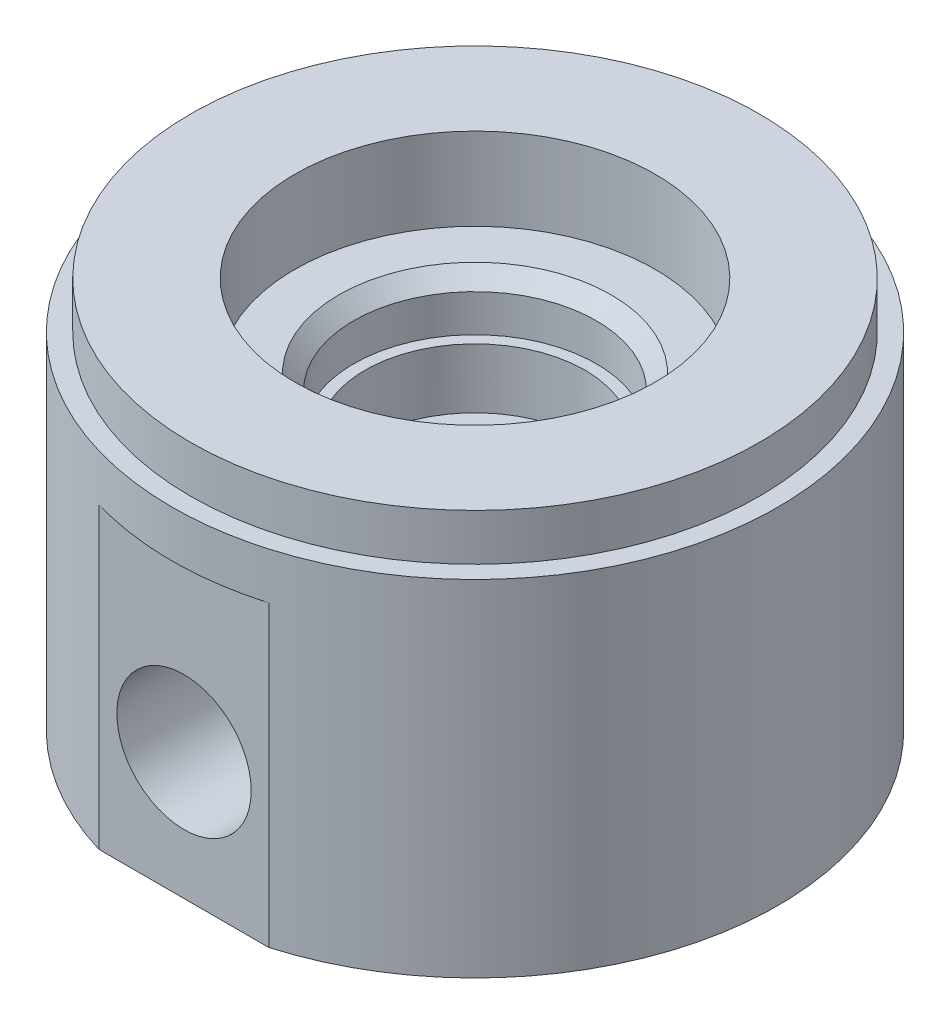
ISO-10303-21;
HEADER;
FILE_DESCRIPTION(('STEP AP214'),'2;1');
FILE_NAME('part.step','',(''),(''),'','','');
FILE_SCHEMA(('AUTOMOTIVE_DESIGN { 1 0 10303 214 1 1 1 1 }'));
ENDSEC;
DATA;
#1=APPLICATION_CONTEXT('core data for automotive mechanical design processes');
#2=APPLICATION_PROTOCOL_DEFINITION('international standard','automotive_design',2000,#1);
#3=PRODUCT_CONTEXT('',#1,'mechanical');
#4=PRODUCT('Part','Part','',(#3));
#5=PRODUCT_RELATED_PRODUCT_CATEGORY('part','',(#4));
#6=PRODUCT_DEFINITION_FORMATION('','',#4);
#7=PRODUCT_DEFINITION_CONTEXT('part definition',#1,'design');
#8=PRODUCT_DEFINITION('design','',#6,#7);
#9=PRODUCT_DEFINITION_SHAPE('','',#8);
#10=(LENGTH_UNIT() NAMED_UNIT(*) SI_UNIT(.MILLI.,.METRE.));
#11=(NAMED_UNIT(*) PLANE_ANGLE_UNIT() SI_UNIT($,.RADIAN.));
#12=(NAMED_UNIT(*) SI_UNIT($,.STERADIAN.) SOLID_ANGLE_UNIT());
#13=UNCERTAINTY_MEASURE_WITH_UNIT(LENGTH_MEASURE(1.E-05),#10,'distance_accuracy_value','');
#14=(GEOMETRIC_REPRESENTATION_CONTEXT(3) GLOBAL_UNCERTAINTY_ASSIGNED_CONTEXT((#13)) GLOBAL_UNIT_ASSIGNED_CONTEXT((#10,
#11,#12)) REPRESENTATION_CONTEXT('',''));
#15=CARTESIAN_POINT('',(0.,0.,0.));
#16=DIRECTION('',(0.,0.,1.));
#17=DIRECTION('',(1.,0.,0.));
#18=AXIS2_PLACEMENT_3D('',#15,#16,#17);
#19=CARTESIAN_POINT('',(0.,13.4366,0.));
#20=DIRECTION('',(0.,1.,0.));
#21=DIRECTION('',(0.,0.,1.00000000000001));
#22=AXIS2_PLACEMENT_3D('',#19,#20,#21);
#23=CYLINDRICAL_SURFACE('',#22,7.493);
#24=CARTESIAN_POINT('',(0.,17.5006,0.));
#25=DIRECTION('',(0.,1.,0.));
#26=DIRECTION('',(0.,0.,1.00000000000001));
#27=AXIS2_PLACEMENT_3D('',#24,#25,#26);
#28=CIRCLE('',#27,7.493);
#29=CARTESIAN_POINT('',(0.,17.5006,7.49300000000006));
#30=VERTEX_POINT('',#29);
#31=EDGE_CURVE('E104',#30,#30,#28,.T.);
#32=ORIENTED_EDGE('',*,*,#31,.T.);
#33=EDGE_LOOP('',(#32));
#34=FACE_BOUND('',#33,.T.);
#35=CARTESIAN_POINT('',(0.,10.560501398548,7.493));
#36=CARTESIAN_POINT('',(-0.0485641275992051,10.5616580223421,7.49299864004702));
#37=CARTESIAN_POINT('',(-0.0970909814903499,10.5673567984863,7.49252109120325));
#38=CARTESIAN_POINT('',(-0.192446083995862,10.5871524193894,7.4906816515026));
#39=CARTESIAN_POINT('',(-0.239268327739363,10.6012763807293,7.48931690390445));
#40=CARTESIAN_POINT('',(-0.342619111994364,10.6413911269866,7.48538705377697));
#41=CARTESIAN_POINT('',(-0.398278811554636,10.6695764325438,7.4825951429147));
#42=CARTESIAN_POINT('',(-0.504352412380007,10.7343463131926,7.47619668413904));
#43=CARTESIAN_POINT('',(-0.554757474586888,10.7709447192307,7.47258879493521));
#44=CARTESIAN_POINT('',(-0.680990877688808,10.8753325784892,7.46240630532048));
#45=CARTESIAN_POINT('',(-0.752584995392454,10.9481497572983,7.45540487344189));
#46=CARTESIAN_POINT('',(-0.884412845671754,11.1033043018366,7.44091796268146));
#47=CARTESIAN_POINT('',(-0.94461592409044,11.1856664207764,7.43343124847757));
#48=CARTESIAN_POINT('',(-1.05238660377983,11.3515624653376,7.41891500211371));
#49=CARTESIAN_POINT('',(-1.10048009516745,11.4347596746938,7.41188382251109));
#50=CARTESIAN_POINT('',(-1.18949771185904,11.6049697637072,7.39811947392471));
#51=CARTESIAN_POINT('',(-1.23041571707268,11.691985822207,7.3913865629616));
#52=CARTESIAN_POINT('',(-1.30597496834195,11.868965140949,7.37841094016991));
#53=CARTESIAN_POINT('',(-1.34060082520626,11.9589350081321,7.37216945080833));
#54=CARTESIAN_POINT('',(-1.40401749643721,12.140958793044,7.36035464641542));
#55=CARTESIAN_POINT('',(-1.43280677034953,12.233013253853,7.35478150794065));
#56=CARTESIAN_POINT('',(-1.49653941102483,12.4602220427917,7.34213227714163));
#57=CARTESIAN_POINT('',(-1.52848200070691,12.5962501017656,7.33549780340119));
#58=CARTESIAN_POINT('',(-1.5812939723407,12.8705855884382,7.32429378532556));
#59=CARTESIAN_POINT('',(-1.60215668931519,13.0088943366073,7.31972548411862));
#60=CARTESIAN_POINT('',(-1.63252231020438,13.2865442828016,7.31301341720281));
#61=CARTESIAN_POINT('',(-1.64204869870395,13.4258827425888,7.31086463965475));
#62=CARTESIAN_POINT('',(-1.64899972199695,13.7047742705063,7.30929939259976));
#63=CARTESIAN_POINT('',(-1.64643396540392,13.8443270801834,7.30988075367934));
#64=CARTESIAN_POINT('',(-1.62676906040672,14.1374832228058,7.31428921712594));
#65=CARTESIAN_POINT('',(-1.6081479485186,14.2909964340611,7.31845612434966));
#66=CARTESIAN_POINT('',(-1.56549862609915,14.5182928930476,7.32764983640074));
#67=CARTESIAN_POINT('',(-1.54883518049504,14.5935445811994,7.33120372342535));
#68=CARTESIAN_POINT('',(-1.51008067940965,14.7425754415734,7.33928467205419));
#69=CARTESIAN_POINT('',(-1.48799106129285,14.8163549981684,7.34381147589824));
#70=CARTESIAN_POINT('',(-1.42556986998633,14.9972610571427,7.35624066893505));
#71=CARTESIAN_POINT('',(-1.38159299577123,15.103134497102,7.36471349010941));
#72=CARTESIAN_POINT('',(-1.27815855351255,15.3069247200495,7.38336834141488));
#73=CARTESIAN_POINT('',(-1.2187271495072,15.4048545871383,7.39354747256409));
#74=CARTESIAN_POINT('',(-1.10240219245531,15.56088482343,7.41161998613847));
#75=CARTESIAN_POINT('',(-1.04987318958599,15.6222447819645,7.41930853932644));
#76=CARTESIAN_POINT('',(-0.935758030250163,15.735933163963,7.43456182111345));
#77=CARTESIAN_POINT('',(-0.874184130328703,15.788273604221,7.44212670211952));
#78=CARTESIAN_POINT('',(-0.753756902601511,15.8729914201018,7.45519307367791));
#79=CARTESIAN_POINT('',(-0.696250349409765,15.9072532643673,7.4608258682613));
#80=CARTESIAN_POINT('',(-0.576244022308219,15.9657831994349,7.47105124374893));
#81=CARTESIAN_POINT('',(-0.513746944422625,15.9900566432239,7.47564438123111));
#82=CARTESIAN_POINT('',(-0.385017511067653,16.0272611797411,7.48338026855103));
#83=CARTESIAN_POINT('',(-0.318768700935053,16.0401373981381,7.48651596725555));
#84=CARTESIAN_POINT('',(-0.184974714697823,16.0535959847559,7.49101515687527));
#85=CARTESIAN_POINT('',(-0.117429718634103,16.0541800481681,7.49237889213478));
#86=CARTESIAN_POINT('',(0.0113190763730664,16.0437070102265,7.49324631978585));
#87=CARTESIAN_POINT('',(0.0726007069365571,16.0335700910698,7.49288903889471));
#88=CARTESIAN_POINT('',(0.192780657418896,16.0038619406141,7.49076100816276));
#89=CARTESIAN_POINT('',(0.251678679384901,15.9842895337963,7.48899008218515));
#90=CARTESIAN_POINT('',(0.369586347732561,15.9353499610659,7.48412714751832));
#91=CARTESIAN_POINT('',(0.42836516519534,15.9054393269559,7.48095832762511));
#92=CARTESIAN_POINT('',(0.541127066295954,15.8377858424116,7.47364901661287));
#93=CARTESIAN_POINT('',(0.595107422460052,15.8000385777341,7.46950797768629));
#94=CARTESIAN_POINT('',(0.726169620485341,15.6956484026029,7.4581588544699));
#95=CARTESIAN_POINT('',(0.799653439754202,15.6245226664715,7.45051552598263));
#96=CARTESIAN_POINT('',(0.934286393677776,15.4714532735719,7.434834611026));
#97=CARTESIAN_POINT('',(0.995404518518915,15.389483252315,7.42679609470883));
#98=CARTESIAN_POINT('',(1.13210740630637,15.1778551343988,7.40744199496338));
#99=CARTESIAN_POINT('',(1.20100814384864,15.0438787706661,7.39636014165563));
#100=CARTESIAN_POINT('',(1.31735326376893,14.7668671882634,7.37652216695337));
#101=CARTESIAN_POINT('',(1.36476206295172,14.6238173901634,7.36776991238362));
#102=CARTESIAN_POINT('',(1.43192827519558,14.3680082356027,7.35496184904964));
#103=CARTESIAN_POINT('',(1.45559752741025,14.2562687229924,7.35028239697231));
#104=CARTESIAN_POINT('',(1.49338884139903,14.0310820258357,7.34269808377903));
#105=CARTESIAN_POINT('',(1.50750582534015,13.9176339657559,7.33979416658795));
#106=CARTESIAN_POINT('',(1.52699421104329,13.6896971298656,7.33576393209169));
#107=CARTESIAN_POINT('',(1.53234386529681,13.5752064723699,7.33464203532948));
#108=CARTESIAN_POINT('',(1.53477759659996,13.3461672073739,7.33413303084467));
#109=CARTESIAN_POINT('',(1.53186334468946,13.2316186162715,7.33474557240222));
#110=CARTESIAN_POINT('',(1.51779184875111,12.9983156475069,7.33767070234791));
#111=CARTESIAN_POINT('',(1.50630005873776,12.8795823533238,7.3400522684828));
#112=CARTESIAN_POINT('',(1.47473446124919,12.643261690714,7.34645954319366));
#113=CARTESIAN_POINT('',(1.45465774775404,12.5256747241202,7.3504858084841));
#114=CARTESIAN_POINT('',(1.40573416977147,12.2928663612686,7.35999868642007));
#115=CARTESIAN_POINT('',(1.3769217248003,12.1776375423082,7.36547955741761));
#116=CARTESIAN_POINT('',(1.30983725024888,11.9500920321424,7.37770606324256));
#117=CARTESIAN_POINT('',(1.27157311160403,11.8377729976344,7.3844506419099));
#118=CARTESIAN_POINT('',(1.1929099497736,11.6390839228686,7.39751799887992));
#119=CARTESIAN_POINT('',(1.15441000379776,11.5519540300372,7.40366296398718));
#120=CARTESIAN_POINT('',(1.06939426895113,11.3815033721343,7.41642106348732));
#121=CARTESIAN_POINT('',(1.02286725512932,11.2981881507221,7.42303484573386));
#122=CARTESIAN_POINT('',(0.919893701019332,11.1366945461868,7.43650338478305));
#123=CARTESIAN_POINT('',(0.863354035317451,11.0585747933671,7.44335987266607));
#124=CARTESIAN_POINT('',(0.73871063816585,10.9121057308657,7.45676042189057));
#125=CARTESIAN_POINT('',(0.670649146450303,10.8437223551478,7.46330551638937));
#126=CARTESIAN_POINT('',(0.55535919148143,10.7508508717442,7.47250053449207));
#127=CARTESIAN_POINT('',(0.512837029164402,10.7205900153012,7.47556298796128));
#128=CARTESIAN_POINT('',(0.423800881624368,10.6664896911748,7.48113803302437));
#129=CARTESIAN_POINT('',(0.377290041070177,10.6426452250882,7.4836510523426));
#130=CARTESIAN_POINT('',(0.286571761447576,10.6055639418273,7.48763869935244));
#131=CARTESIAN_POINT('',(0.242750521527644,10.5914015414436,7.48920139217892));
#132=CARTESIAN_POINT('',(0.153378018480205,10.5706606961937,7.49156221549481));
#133=CARTESIAN_POINT('',(0.107831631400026,10.5640623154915,7.49236235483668));
#134=CARTESIAN_POINT('',(0.0414315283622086,10.5603410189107,7.49291454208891));
#135=CARTESIAN_POINT('',(0.0207123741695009,10.5600081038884,7.49300058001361));
#136=CARTESIAN_POINT('',(0.,10.560501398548,7.493));
#137=B_SPLINE_CURVE_WITH_KNOTS('',3,(#35,#36,#37,#38,#39,#40,#41,#42,#43,#44,#45,#46,#47,#48,
#49,#50,#51,#52,#53,#54,#55,#56,#57,#58,#59,#60,#61,#62,#63,#64,#65,#66,#67,#68,#69,#70,#71,#72,
#73,#74,#75,#76,#77,#78,#79,#80,#81,#82,#83,#84,#85,#86,#87,#88,#89,#90,#91,#92,#93,#94,#95,#96,
#97,#98,#99,#100,#101,#102,#103,#104,#105,#106,#107,#108,#109,#110,#111,#112,#113,#114,#115,
#116,#117,#118,#119,#120,#121,#122,#123,#124,#125,#126,#127,#128,#129,#130,#131,#132,#133,#134,
#135,#136),.UNSPECIFIED.,.T.,.F.,(4,2,2,2,2,2,2,2,2,2,2,2,2,2,2,2,2,2,2,2,2,2,2,2,2,2,2,2,2,2,2,
2,2,2,2,2,2,2,2,2,2,2,2,2,2,2,2,2,2,2,4),(0.,0.145663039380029,0.291797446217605,
0.478092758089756,0.664696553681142,0.970051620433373,1.27621708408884,1.5648637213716,
1.85375536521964,2.14334433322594,2.43300963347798,2.85214497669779,3.27153216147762,
3.69004901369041,4.1082333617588,4.57105177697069,4.80234663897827,5.03358029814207,
5.37739352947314,5.72062844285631,5.96323162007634,6.20550903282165,6.40620525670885,
6.60679378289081,6.80834291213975,7.00986424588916,7.19539253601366,7.38094394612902,
7.57828858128,7.77574468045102,8.08166422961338,8.38834168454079,8.83903155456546,
9.29046490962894,9.63297025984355,9.97565753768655,10.3191935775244,10.6626601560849,
11.0202724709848,11.378005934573,11.7343478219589,12.0903932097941,12.3764319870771,
12.662874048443,12.9521354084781,13.2403584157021,13.3967770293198,13.5530734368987,
13.6907409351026,13.8280447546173,13.8901693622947),.UNSPECIFIED.);
#138=CARTESIAN_POINT('',(-1.64060286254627,13.4366,7.31118808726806));
#139=VERTEX_POINT('',#138);
#140=CARTESIAN_POINT('',(1.53375573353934,13.4366,7.33434675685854));
#141=VERTEX_POINT('',#140);
#142=EDGE_CURVE('E47',#139,#141,#137,.T.);
#143=ORIENTED_EDGE('',*,*,#142,.F.);
#144=CARTESIAN_POINT('',(0.,13.4366,0.));
#145=DIRECTION('',(0.,1.,0.));
#146=DIRECTION('',(0.,0.,1.00000000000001));
#147=AXIS2_PLACEMENT_3D('',#144,#145,#146);
#148=CIRCLE('',#147,7.493);
#149=EDGE_CURVE('E101',#141,#139,#148,.T.);
#150=ORIENTED_EDGE('',*,*,#149,.F.);
#151=EDGE_LOOP('',(#143,#150));
#152=FACE_BOUND('',#151,.T.);
#153=ADVANCED_FACE('F32',(#34,#152),#23,.F.);
#154=CARTESIAN_POINT('',(0.,13.4366,0.));
#155=DIRECTION('',(0.,1.,0.));
#156=DIRECTION('',(0.,0.,1.00000000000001));
#157=AXIS2_PLACEMENT_3D('',#154,#155,#156);
#158=PLANE('',#157);
#159=CARTESIAN_POINT('',(0.,13.4366,0.));
#160=DIRECTION('',(0.,1.,0.));
#161=DIRECTION('',(0.,0.,1.00000000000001));
#162=AXIS2_PLACEMENT_3D('',#159,#160,#161);
#163=CIRCLE('',#162,0.533400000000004);
#164=CARTESIAN_POINT('',(0.,13.4366,0.533400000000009));
#165=VERTEX_POINT('',#164);
#166=EDGE_CURVE('E12',#165,#165,#163,.F.);
#167=ORIENTED_EDGE('',*,*,#166,.T.);
#168=EDGE_LOOP('',(#167));
#169=FACE_BOUND('',#168,.T.);
#170=ORIENTED_EDGE('',*,*,#149,.T.);
#171=CARTESIAN_POINT('',(-0.0524187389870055,13.4366,7.40012059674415));
#172=DIRECTION('',(0.,1.,0.));
#173=DIRECTION('',(-0.0533102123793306,0.,-0.998577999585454));
#174=AXIS2_PLACEMENT_3D('',#171,#172,#173);
#175=ELLIPSE('',#174,1.94674155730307,1.5875);
#176=EDGE_CURVE('E81',#139,#141,#175,.F.);
#177=ORIENTED_EDGE('',*,*,#176,.T.);
#178=EDGE_LOOP('',(#170,#177));
#179=FACE_BOUND('',#178,.T.);
#180=ADVANCED_FACE('F157',(#169,#179),#158,.T.);
#181=CARTESIAN_POINT('',(0.,8.63599999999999,8.382));
#182=DIRECTION('',(0.,0.,1.00000000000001));
#183=DIRECTION('',(1.00000000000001,0.,0.));
#184=AXIS2_PLACEMENT_3D('',#181,#182,#183);
#185=CYLINDRICAL_SURFACE('',#184,4.572);
#186=CARTESIAN_POINT('',(0.,8.63599999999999,19.812));
#187=DIRECTION('',(0.,0.,1.00000000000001));
#188=DIRECTION('',(1.00000000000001,0.,0.));
#189=AXIS2_PLACEMENT_3D('',#186,#187,#188);
#190=CIRCLE('',#189,4.572);
#191=CARTESIAN_POINT('',(4.57200000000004,8.63599999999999,19.812));
#192=VERTEX_POINT('',#191);
#193=EDGE_CURVE('E86',#192,#192,#190,.T.);
#194=ORIENTED_EDGE('',*,*,#193,.T.);
#195=EDGE_LOOP('',(#194));
#196=FACE_BOUND('',#195,.T.);
#197=CARTESIAN_POINT('',(1.47503154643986,12.9635242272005,8.38200000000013));
#198=CARTESIAN_POINT('',(1.46239269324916,12.9678284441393,8.42520154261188));
#199=CARTESIAN_POINT('',(1.44817930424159,12.9726151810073,8.46788279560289));
#200=CARTESIAN_POINT('',(1.41652132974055,12.9830606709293,8.55194445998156));
#201=CARTESIAN_POINT('',(1.39907498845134,12.9887198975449,8.59332415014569));
#202=CARTESIAN_POINT('',(1.34176507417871,13.0068654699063,8.71509534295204));
#203=CARTESIAN_POINT('',(1.29694456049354,13.020514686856,8.79307007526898));
#204=CARTESIAN_POINT('',(1.19432161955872,13.0495719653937,8.93999569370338));
#205=CARTESIAN_POINT('',(1.13647396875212,13.0649860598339,9.00891378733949));
#206=CARTESIAN_POINT('',(1.00924725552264,13.0956930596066,9.13500203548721));
#207=CARTESIAN_POINT('',(0.939884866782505,13.1109861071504,9.19218891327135));
#208=CARTESIAN_POINT('',(0.795970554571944,13.1387397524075,9.2902407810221));
#209=CARTESIAN_POINT('',(0.721951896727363,13.1513131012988,9.33185928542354));
#210=CARTESIAN_POINT('',(0.567579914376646,13.1733021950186,9.40230699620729));
#211=CARTESIAN_POINT('',(0.487223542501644,13.1827164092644,9.43113000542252));
#212=CARTESIAN_POINT('',(0.323369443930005,13.1972842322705,9.47520850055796));
#213=CARTESIAN_POINT('',(0.239910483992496,13.2024789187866,9.49059490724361));
#214=CARTESIAN_POINT('',(0.0714730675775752,13.2082177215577,9.50807785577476));
#215=CARTESIAN_POINT('',(-0.0135051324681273,13.2087626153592,9.51017661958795));
#216=CARTESIAN_POINT('',(-0.18357457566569,13.2051133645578,9.50106964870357));
#217=CARTESIAN_POINT('',(-0.268656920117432,13.2008674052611,9.48971838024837));
#218=CARTESIAN_POINT('',(-0.435627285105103,13.1879697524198,9.45372949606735));
#219=CARTESIAN_POINT('',(-0.51751480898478,13.1793173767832,9.42908982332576));
#220=CARTESIAN_POINT('',(-0.676482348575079,13.1583931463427,9.36679226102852));
#221=CARTESIAN_POINT('',(-0.753516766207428,13.1460918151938,9.32902790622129));
#222=CARTESIAN_POINT('',(-0.89989693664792,13.1191811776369,9.24142638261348));
#223=CARTESIAN_POINT('',(-0.969245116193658,13.104572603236,9.19159304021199));
#224=CARTESIAN_POINT('',(-1.0990913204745,13.07443143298,9.08066627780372));
#225=CARTESIAN_POINT('',(-1.159507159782,13.0588919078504,9.01947872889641));
#226=CARTESIAN_POINT('',(-1.26952827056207,13.0285787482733,8.88783307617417));
#227=CARTESIAN_POINT('',(-1.3191271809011,13.0138055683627,8.81736955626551));
#228=CARTESIAN_POINT('',(-1.39657535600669,12.9896206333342,8.68660594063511));
#229=CARTESIAN_POINT('',(-1.426799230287,12.9797621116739,8.62776946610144));
#230=CARTESIAN_POINT('',(-1.48044171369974,12.9617641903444,8.50700260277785));
#231=CARTESIAN_POINT('',(-1.50387782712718,12.9536203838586,8.44508066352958));
#232=CARTESIAN_POINT('',(-1.52398300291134,12.9465289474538,8.38200000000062));
#233=B_SPLINE_CURVE_WITH_KNOTS('',3,(#197,#198,#199,#200,#201,#202,#203,#204,#205,#206,#207,
#208,#209,#210,#211,#212,#213,#214,#215,#216,#217,#218,#219,#220,#221,#222,#223,#224,#225,#226,
#227,#228,#229,#230,#231,#232),.UNSPECIFIED.,.F.,.F.,(4,2,2,2,2,2,2,2,2,2,2,2,2,2,2,2,2,4),(0.,
0.135591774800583,0.271257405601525,0.542740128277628,0.815180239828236,1.08722923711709,
1.34352124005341,1.59993723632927,1.85382601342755,2.10767233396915,2.36429062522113,
2.62094865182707,2.87973920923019,3.13844782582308,3.39940566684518,3.66051655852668,
3.86071606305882,4.06039459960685),.UNSPECIFIED.);
#234=CARTESIAN_POINT('',(1.47503154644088,12.9635242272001,8.38200000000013));
#235=VERTEX_POINT('',#234);
#236=CARTESIAN_POINT('',(-1.52398300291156,12.9465289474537,8.38200000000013));
#237=VERTEX_POINT('',#236);
#238=EDGE_CURVE('E54',#235,#237,#233,.T.);
#239=ORIENTED_EDGE('',*,*,#238,.F.);
#240=CARTESIAN_POINT('',(0.,8.63599999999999,8.382));
#241=DIRECTION('',(0.,0.,1.00000000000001));
#242=DIRECTION('',(1.00000000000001,0.,0.));
#243=AXIS2_PLACEMENT_3D('',#240,#241,#242);
#244=CIRCLE('',#243,4.572);
#245=EDGE_CURVE('E80',#237,#235,#244,.T.);
#246=ORIENTED_EDGE('',*,*,#245,.F.);
#247=EDGE_LOOP('',(#239,#246));
#248=FACE_BOUND('',#247,.T.);
#249=ADVANCED_FACE('F79',(#196,#248),#185,.F.);
#250=CARTESIAN_POINT('',(0.,8.63599999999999,8.382));
#251=DIRECTION('',(0.,0.,1.00000000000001));
#252=DIRECTION('',(1.00000000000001,0.,0.));
#253=AXIS2_PLACEMENT_3D('',#250,#251,#252);
#254=PLANE('',#253);
#255=ORIENTED_EDGE('',*,*,#245,.T.);
#256=CARTESIAN_POINT('',(0.,12.0512851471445,8.38200000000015));
#257=DIRECTION('',(0.,0.,1.00000000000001));
#258=DIRECTION('',(-0.0378118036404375,0.999284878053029,0.));
#259=AXIS2_PLACEMENT_3D('',#256,#257,#258);
#260=ELLIPSE('',#259,2.74662039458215,1.5875);
#261=EDGE_CURVE('E71',#235,#237,#260,.F.);
#262=ORIENTED_EDGE('',*,*,#261,.T.);
#263=EDGE_LOOP('',(#255,#262));
#264=FACE_BOUND('',#263,.T.);
#265=ADVANCED_FACE('F84',(#264),#254,.T.);
#266=CARTESIAN_POINT('',(0.,26.67,0.));
#267=DIRECTION('',(0.,-1.,0.));
#268=DIRECTION('',(0.,0.,-1.00000000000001));
#269=AXIS2_PLACEMENT_3D('',#266,#267,#268);
#270=CYLINDRICAL_SURFACE('',#269,20.6375);
#271=CARTESIAN_POINT('',(0.,23.495,0.));
#272=DIRECTION('',(0.,1.,0.));
#273=DIRECTION('',(0.,0.,1.00000000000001));
#274=AXIS2_PLACEMENT_3D('',#271,#272,#273);
#275=CIRCLE('',#274,20.6375);
#276=CARTESIAN_POINT('',(0.,23.495,20.6375000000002));
#277=VERTEX_POINT('',#276);
#278=EDGE_CURVE('E120',#277,#277,#275,.T.);
#279=ORIENTED_EDGE('',*,*,#278,.F.);
#280=EDGE_LOOP('',(#279));
#281=FACE_BOUND('',#280,.T.);
#282=CARTESIAN_POINT('',(0.,20.32,0.));
#283=DIRECTION('',(0.,-1.,0.));
#284=DIRECTION('',(0.,0.,-1.00000000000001));
#285=AXIS2_PLACEMENT_3D('',#282,#283,#284);
#286=CIRCLE('',#285,20.6375);
#287=CARTESIAN_POINT('',(5.77850000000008,20.32,19.812));
#288=VERTEX_POINT('',#287);
#289=CARTESIAN_POINT('',(-5.77849999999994,20.32,19.8120000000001));
#290=VERTEX_POINT('',#289);
#291=EDGE_CURVE('E76',#288,#290,#286,.T.);
#292=ORIENTED_EDGE('',*,*,#291,.F.);
#293=DIRECTION('',(0.,-1.,0.));
#294=VECTOR('',#293,1.);
#295=CARTESIAN_POINT('',(5.7785000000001,26.67,19.8119999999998));
#296=LINE('',#295,#294);
#297=CARTESIAN_POINT('',(5.77850000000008,1.52655665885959E-13,19.812));
#298=VERTEX_POINT('',#297);
#299=EDGE_CURVE('E98',#288,#298,#296,.T.);
#300=ORIENTED_EDGE('',*,*,#299,.T.);
#301=CARTESIAN_POINT('',(0.,2.63677968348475E-13,0.));
#302=DIRECTION('',(0.,1.,0.));
#303=DIRECTION('',(0.,0.,1.00000000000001));
#304=AXIS2_PLACEMENT_3D('',#301,#302,#303);
#305=CIRCLE('',#304,20.6375);
#306=CARTESIAN_POINT('',(-5.7785,1.11022302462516E-13,19.8120000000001));
#307=VERTEX_POINT('',#306);
#308=EDGE_CURVE('E121',#298,#307,#305,.T.);
#309=ORIENTED_EDGE('',*,*,#308,.T.);
#310=DIRECTION('',(0.,-1.,0.));
#311=VECTOR('',#310,1.);
#312=CARTESIAN_POINT('',(-5.7785,26.67,19.812));
#313=LINE('',#312,#311);
#314=EDGE_CURVE('E89',#307,#290,#313,.F.);
#315=ORIENTED_EDGE('',*,*,#314,.T.);
#316=EDGE_LOOP('',(#292,#300,#309,#315));
#317=FACE_BOUND('',#316,.T.);
#318=CARTESIAN_POINT('',(0.,12.7635,-20.6375000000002));
#319=CARTESIAN_POINT('',(0.229393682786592,12.7634915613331,-20.6374957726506));
#320=CARTESIAN_POINT('',(0.458894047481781,12.7443119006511,-20.6336360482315));
#321=CARTESIAN_POINT('',(0.911407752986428,12.6681609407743,-20.6186111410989));
#322=CARTESIAN_POINT('',(1.13441579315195,12.6111596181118,-20.6074401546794));
#323=CARTESIAN_POINT('',(1.5673368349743,12.4611966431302,-20.5790401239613));
#324=CARTESIAN_POINT('',(1.77726215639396,12.3682694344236,-20.5618168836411));
#325=CARTESIAN_POINT('',(2.17852747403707,12.1491948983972,-20.523184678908));
#326=CARTESIAN_POINT('',(2.36986857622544,12.0230495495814,-20.5017759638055));
#327=CARTESIAN_POINT('',(2.73113982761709,11.7393083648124,-20.4568048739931));
#328=CARTESIAN_POINT('',(2.9007820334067,11.5813495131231,-20.4332195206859));
#329=CARTESIAN_POINT('',(3.21134671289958,11.2392455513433,-20.3867205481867));
#330=CARTESIAN_POINT('',(3.35226694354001,11.055098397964,-20.3638069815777));
#331=CARTESIAN_POINT('',(3.60261306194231,10.6637739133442,-20.3210215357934));
#332=CARTESIAN_POINT('',(3.71174080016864,10.4564023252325,-20.3011792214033));
#333=CARTESIAN_POINT('',(3.89349413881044,10.0258042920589,-20.267109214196));
#334=CARTESIAN_POINT('',(3.96612334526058,9.80257941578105,-20.252880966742));
#335=CARTESIAN_POINT('',(4.07188317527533,9.34970928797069,-20.2318825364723));
#336=CARTESIAN_POINT('',(4.10551899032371,9.12018652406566,-20.2250170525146));
#337=CARTESIAN_POINT('',(4.13390640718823,8.65866071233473,-20.2192346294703));
#338=CARTESIAN_POINT('',(4.12866198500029,8.42665792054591,-20.2203168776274));
#339=CARTESIAN_POINT('',(4.07984625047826,7.97045388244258,-20.2302210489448));
#340=CARTESIAN_POINT('',(4.03685407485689,7.74618774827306,-20.2389260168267));
#341=CARTESIAN_POINT('',(3.91467736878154,7.30811689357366,-20.2629106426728));
#342=CARTESIAN_POINT('',(3.83549110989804,7.09431267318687,-20.2781906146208));
#343=CARTESIAN_POINT('',(3.64262104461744,6.68156575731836,-20.3137231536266));
#344=CARTESIAN_POINT('',(3.52870768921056,6.48273327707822,-20.3340086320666));
#345=CARTESIAN_POINT('',(3.26977897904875,6.10678831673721,-20.3772453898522));
#346=CARTESIAN_POINT('',(3.12476004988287,5.92967833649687,-20.4001969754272));
#347=CARTESIAN_POINT('',(2.8046359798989,5.59886414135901,-20.4466865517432));
#348=CARTESIAN_POINT('',(2.62903655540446,5.44563827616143,-20.4702276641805));
#349=CARTESIAN_POINT('',(2.25437868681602,5.17074149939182,-20.5148657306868));
#350=CARTESIAN_POINT('',(2.05531994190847,5.04907099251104,-20.5359626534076));
#351=CARTESIAN_POINT('',(1.63886261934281,4.84065020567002,-20.573387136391));
#352=CARTESIAN_POINT('',(1.42143596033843,4.75395460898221,-20.5897072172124));
#353=CARTESIAN_POINT('',(0.974704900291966,4.61845464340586,-20.6156824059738));
#354=CARTESIAN_POINT('',(0.745401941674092,4.56964568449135,-20.6253383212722));
#355=CARTESIAN_POINT('',(0.285537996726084,4.51198173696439,-20.6367847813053));
#356=CARTESIAN_POINT('',(0.0550622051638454,4.50247211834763,-20.6387041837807));
#357=CARTESIAN_POINT('',(-0.404185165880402,4.5219137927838,-20.634819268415));
#358=CARTESIAN_POINT('',(-0.632956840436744,4.55086292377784,-20.6290153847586));
#359=CARTESIAN_POINT('',(-1.08019011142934,4.64585648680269,-20.6104166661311));
#360=CARTESIAN_POINT('',(-1.29872591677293,4.71156502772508,-20.5976851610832));
#361=CARTESIAN_POINT('',(-1.72167777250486,4.87784513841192,-20.5666536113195));
#362=CARTESIAN_POINT('',(-1.92609276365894,4.97841932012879,-20.5483531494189));
#363=CARTESIAN_POINT('',(-2.31776119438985,5.21299198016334,-20.5078928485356));
#364=CARTESIAN_POINT('',(-2.50477389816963,5.34738457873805,-20.485688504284));
#365=CARTESIAN_POINT('',(-2.85382787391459,5.64525143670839,-20.4399881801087));
#366=CARTESIAN_POINT('',(-3.0158664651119,5.80872881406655,-20.4164920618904));
#367=CARTESIAN_POINT('',(-3.3128990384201,6.16310475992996,-20.3704220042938));
#368=CARTESIAN_POINT('',(-3.44744361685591,6.35438298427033,-20.3478675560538));
#369=CARTESIAN_POINT('',(-3.68249532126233,6.75720889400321,-20.3066475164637));
#370=CARTESIAN_POINT('',(-3.78300380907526,6.96875576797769,-20.2879817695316));
#371=CARTESIAN_POINT('',(-3.9465167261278,7.40504843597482,-20.2568099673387));
#372=CARTESIAN_POINT('',(-4.00971559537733,7.62971897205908,-20.2442720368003));
#373=CARTESIAN_POINT('',(-4.09740495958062,8.08676782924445,-20.2267079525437));
#374=CARTESIAN_POINT('',(-4.12190050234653,8.31914514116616,-20.2216808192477));
#375=CARTESIAN_POINT('',(-4.1313010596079,8.78049908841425,-20.2197619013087));
#376=CARTESIAN_POINT('',(-4.11691621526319,9.00946094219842,-20.2227241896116));
#377=CARTESIAN_POINT('',(-4.0505316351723,9.46163063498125,-20.2361242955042));
#378=CARTESIAN_POINT('',(-3.99853220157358,9.68483852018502,-20.2465620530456));
#379=CARTESIAN_POINT('',(-3.85871129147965,10.1187123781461,-20.2736717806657));
#380=CARTESIAN_POINT('',(-3.77097689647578,10.329407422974,-20.2903285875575));
#381=CARTESIAN_POINT('',(-3.56225804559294,10.7331981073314,-20.3280082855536));
#382=CARTESIAN_POINT('',(-3.44127080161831,10.9262922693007,-20.3490315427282));
#383=CARTESIAN_POINT('',(-3.16705516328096,11.2929360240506,-20.3935218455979));
#384=CARTESIAN_POINT('',(-3.01331392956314,11.4660978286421,-20.4170243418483));
#385=CARTESIAN_POINT('',(-2.67901318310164,11.7844000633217,-20.4635705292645));
#386=CARTESIAN_POINT('',(-2.49844751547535,11.9295340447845,-20.486614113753));
#387=CARTESIAN_POINT('',(-2.11335276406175,12.189094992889,-20.5299304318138));
#388=CARTESIAN_POINT('',(-1.90859267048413,12.3031847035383,-20.5501716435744));
#389=CARTESIAN_POINT('',(-1.48245915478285,12.4951552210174,-20.5852922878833));
#390=CARTESIAN_POINT('',(-1.26110091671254,12.5730686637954,-20.6001765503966));
#391=CARTESIAN_POINT('',(-0.866038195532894,12.6753859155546,-20.6200147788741));
#392=CARTESIAN_POINT('',(-0.694582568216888,12.7083697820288,-20.6265333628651));
#393=CARTESIAN_POINT('',(-0.348771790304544,12.7524296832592,-20.6352775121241));
#394=CARTESIAN_POINT('',(-0.174416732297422,12.7635064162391,-20.6375032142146));
#395=CARTESIAN_POINT('',(0.,12.7635,-20.6375000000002));
#396=B_SPLINE_CURVE_WITH_KNOTS('',3,(#318,#319,#320,#321,#322,#323,#324,#325,#326,#327,#328,
#329,#330,#331,#332,#333,#334,#335,#336,#337,#338,#339,#340,#341,#342,#343,#344,#345,#346,#347,
#348,#349,#350,#351,#352,#353,#354,#355,#356,#357,#358,#359,#360,#361,#362,#363,#364,#365,#366,
#367,#368,#369,#370,#371,#372,#373,#374,#375,#376,#377,#378,#379,#380,#381,#382,#383,#384,#385,
#386,#387,#388,#389,#390,#391,#392,#393,#394,#395),.UNSPECIFIED.,.T.,.F.,(4,2,2,2,2,2,2,2,2,2,2,
2,2,2,2,2,2,2,2,2,2,2,2,2,2,2,2,2,2,2,2,2,2,2,2,2,2,2,4),(0.,0.687542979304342,1.37563239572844,
2.06306374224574,2.75045415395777,3.44618459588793,4.14196935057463,4.84408332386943,
5.54612791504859,6.23897154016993,6.93174431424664,7.61407053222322,8.29642933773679,
8.98340015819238,9.67044996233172,10.3698588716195,11.069276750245,11.7697839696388,
12.4702063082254,13.1589131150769,13.8475812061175,14.5300569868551,15.2125839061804,
15.903466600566,16.5944234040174,17.2959019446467,17.9973524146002,18.6951142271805,
19.3927850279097,20.0777995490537,20.7628085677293,21.446158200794,22.1295651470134,
22.8245828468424,23.5197602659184,24.2222129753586,24.9240307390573,25.446812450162,
25.9695774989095),.UNSPECIFIED.);
#397=CARTESIAN_POINT('',(0.,12.7635,-20.6375000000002));
#398=VERTEX_POINT('',#397);
#399=EDGE_CURVE('E92',#398,#398,#396,.T.);
#400=ORIENTED_EDGE('',*,*,#399,.F.);
#401=EDGE_LOOP('',(#400));
#402=FACE_BOUND('',#401,.T.);
#403=ADVANCED_FACE('F34',(#281,#317,#402),#270,.T.);
#404=CARTESIAN_POINT('',(0.,2.63677968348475E-13,0.));
#405=DIRECTION('',(0.,1.,0.));
#406=DIRECTION('',(0.,0.,1.00000000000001));
#407=AXIS2_PLACEMENT_3D('',#404,#405,#406);
#408=PLANE('',#407);
#409=CARTESIAN_POINT('',(-11.2253201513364,0.,-11.2253201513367));
#410=DIRECTION('',(0.,-1.,0.));
#411=DIRECTION('',(0.,0.,1.00000000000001));
#412=AXIS2_PLACEMENT_3D('',#409,#410,#411);
#413=CIRCLE('',#412,1.9812);
#414=CARTESIAN_POINT('',(-11.2253201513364,0.,-9.24412015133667));
#415=VERTEX_POINT('',#414);
#416=EDGE_CURVE('E346',#415,#415,#413,.T.);
#417=ORIENTED_EDGE('',*,*,#416,.F.);
#418=EDGE_LOOP('',(#417));
#419=FACE_BOUND('',#418,.T.);
#420=CARTESIAN_POINT('',(11.2253201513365,0.,11.2253201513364));
#421=DIRECTION('',(0.,-1.,0.));
#422=DIRECTION('',(0.,0.,-1.00000000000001));
#423=AXIS2_PLACEMENT_3D('',#420,#421,#422);
#424=CIRCLE('',#423,1.9812);
#425=CARTESIAN_POINT('',(11.2253201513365,0.,9.24412015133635));
#426=VERTEX_POINT('',#425);
#427=EDGE_CURVE('E345',#426,#426,#424,.T.);
#428=ORIENTED_EDGE('',*,*,#427,.F.);
#429=EDGE_LOOP('',(#428));
#430=FACE_BOUND('',#429,.T.);
#431=ORIENTED_EDGE('',*,*,#308,.F.);
#432=DIRECTION('',(-1.00000000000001,0.,0.));
#433=VECTOR('',#432,1.);
#434=CARTESIAN_POINT('',(0.,2.63677968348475E-13,19.8120000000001));
#435=LINE('',#434,#433);
#436=EDGE_CURVE('E134',#298,#307,#435,.T.);
#437=ORIENTED_EDGE('',*,*,#436,.T.);
#438=EDGE_LOOP('',(#431,#437));
#439=FACE_BOUND('',#438,.T.);
#440=ADVANCED_FACE('F213',(#419,#430,#439),#408,.F.);
#441=CARTESIAN_POINT('',(0.,23.495,0.));
#442=DIRECTION('',(0.,1.,0.));
#443=DIRECTION('',(0.,0.,1.00000000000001));
#444=AXIS2_PLACEMENT_3D('',#441,#442,#443);
#445=PLANE('',#444);
#446=CARTESIAN_POINT('',(0.,23.495,0.));
#447=DIRECTION('',(0.,1.,0.));
#448=DIRECTION('',(0.,0.,1.00000000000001));
#449=AXIS2_PLACEMENT_3D('',#446,#447,#448);
#450=CIRCLE('',#449,19.3675);
#451=CARTESIAN_POINT('',(0.,23.495,19.3675000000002));
#452=VERTEX_POINT('',#451);
#453=EDGE_CURVE('E117',#452,#452,#450,.T.);
#454=ORIENTED_EDGE('',*,*,#453,.F.);
#455=EDGE_LOOP('',(#454));
#456=FACE_BOUND('',#455,.T.);
#457=ORIENTED_EDGE('',*,*,#278,.T.);
#458=EDGE_LOOP('',(#457));
#459=FACE_BOUND('',#458,.T.);
#460=ADVANCED_FACE('F209',(#456,#459),#445,.T.);
#461=CARTESIAN_POINT('',(0.,23.495,0.));
#462=DIRECTION('',(0.,1.,0.));
#463=DIRECTION('',(0.,0.,1.00000000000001));
#464=AXIS2_PLACEMENT_3D('',#461,#462,#463);
#465=CYLINDRICAL_SURFACE('',#464,19.3675);
#466=ORIENTED_EDGE('',*,*,#453,.T.);
#467=EDGE_LOOP('',(#466));
#468=FACE_BOUND('',#467,.T.);
#469=CARTESIAN_POINT('',(0.,26.67,0.));
#470=DIRECTION('',(0.,1.,0.));
#471=DIRECTION('',(0.,0.,1.00000000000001));
#472=AXIS2_PLACEMENT_3D('',#469,#470,#471);
#473=CIRCLE('',#472,19.3675);
#474=CARTESIAN_POINT('',(0.,26.67,19.3675000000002));
#475=VERTEX_POINT('',#474);
#476=EDGE_CURVE('E114',#475,#475,#473,.T.);
#477=ORIENTED_EDGE('',*,*,#476,.F.);
#478=EDGE_LOOP('',(#477));
#479=FACE_BOUND('',#478,.T.);
#480=ADVANCED_FACE('F206',(#468,#479),#465,.T.);
#481=CARTESIAN_POINT('',(0.,26.67,0.));
#482=DIRECTION('',(0.,1.,0.));
#483=DIRECTION('',(0.,0.,1.00000000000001));
#484=AXIS2_PLACEMENT_3D('',#481,#482,#483);
#485=PLANE('',#484);
#486=CARTESIAN_POINT('',(0.,26.67,0.));
#487=DIRECTION('',(0.,1.,0.));
#488=DIRECTION('',(0.,0.,1.00000000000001));
#489=AXIS2_PLACEMENT_3D('',#486,#487,#488);
#490=CIRCLE('',#489,12.2682);
#491=CARTESIAN_POINT('',(0.,26.67,12.2682000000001));
#492=VERTEX_POINT('',#491);
#493=EDGE_CURVE('E108',#492,#492,#490,.T.);
#494=ORIENTED_EDGE('',*,*,#493,.F.);
#495=EDGE_LOOP('',(#494));
#496=FACE_BOUND('',#495,.T.);
#497=ORIENTED_EDGE('',*,*,#476,.T.);
#498=EDGE_LOOP('',(#497));
#499=FACE_BOUND('',#498,.T.);
#500=ADVANCED_FACE('F204',(#496,#499),#485,.T.);
#501=CARTESIAN_POINT('',(0.,21.0566,0.));
#502=DIRECTION('',(0.,1.,0.));
#503=DIRECTION('',(0.,0.,1.00000000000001));
#504=AXIS2_PLACEMENT_3D('',#501,#502,#503);
#505=CYLINDRICAL_SURFACE('',#504,12.2682);
#506=CARTESIAN_POINT('',(0.,21.0566,0.));
#507=DIRECTION('',(0.,1.,0.));
#508=DIRECTION('',(0.,0.,1.00000000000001));
#509=AXIS2_PLACEMENT_3D('',#506,#507,#508);
#510=CIRCLE('',#509,12.2682);
#511=CARTESIAN_POINT('',(0.,21.0566,12.2682000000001));
#512=VERTEX_POINT('',#511);
#513=EDGE_CURVE('E111',#512,#512,#510,.T.);
#514=ORIENTED_EDGE('',*,*,#513,.F.);
#515=EDGE_LOOP('',(#514));
#516=FACE_BOUND('',#515,.T.);
#517=ORIENTED_EDGE('',*,*,#493,.T.);
#518=EDGE_LOOP('',(#517));
#519=FACE_BOUND('',#518,.T.);
#520=ADVANCED_FACE('F200',(#516,#519),#505,.F.);
#521=CARTESIAN_POINT('',(0.,21.0566,0.));
#522=DIRECTION('',(0.,1.,0.));
#523=DIRECTION('',(0.,0.,1.00000000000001));
#524=AXIS2_PLACEMENT_3D('',#521,#522,#523);
#525=PLANE('',#524);
#526=CARTESIAN_POINT('',(0.,21.0566,0.));
#527=DIRECTION('',(0.,1.,0.));
#528=DIRECTION('',(0.,0.,1.00000000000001));
#529=AXIS2_PLACEMENT_3D('',#526,#527,#528);
#530=CIRCLE('',#529,9.271);
#531=CARTESIAN_POINT('',(0.,21.0566,9.27100000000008));
#532=VERTEX_POINT('',#531);
#533=EDGE_CURVE('E131',#532,#532,#530,.F.);
#534=ORIENTED_EDGE('',*,*,#533,.T.);
#535=EDGE_LOOP('',(#534));
#536=FACE_BOUND('',#535,.T.);
#537=ORIENTED_EDGE('',*,*,#513,.T.);
#538=EDGE_LOOP('',(#537));
#539=FACE_BOUND('',#538,.T.);
#540=ADVANCED_FACE('F196',(#536,#539),#525,.T.);
#541=CARTESIAN_POINT('',(0.,17.5006,0.));
#542=DIRECTION('',(0.,1.,0.));
#543=DIRECTION('',(0.,0.,1.00000000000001));
#544=AXIS2_PLACEMENT_3D('',#541,#542,#543);
#545=CYLINDRICAL_SURFACE('',#544,8.255);
#546=CARTESIAN_POINT('',(0.,20.0406,0.));
#547=DIRECTION('',(0.,1.,0.));
#548=DIRECTION('',(0.,0.,1.00000000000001));
#549=AXIS2_PLACEMENT_3D('',#546,#547,#548);
#550=CIRCLE('',#549,8.255);
#551=CARTESIAN_POINT('',(0.,20.0406,8.25500000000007));
#552=VERTEX_POINT('',#551);
#553=EDGE_CURVE('E124',#552,#552,#550,.T.);
#554=ORIENTED_EDGE('',*,*,#553,.T.);
#555=EDGE_LOOP('',(#554));
#556=FACE_BOUND('',#555,.T.);
#557=CARTESIAN_POINT('',(0.,17.5006,0.));
#558=DIRECTION('',(0.,1.,0.));
#559=DIRECTION('',(0.,0.,1.00000000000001));
#560=AXIS2_PLACEMENT_3D('',#557,#558,#559);
#561=CIRCLE('',#560,8.255);
#562=CARTESIAN_POINT('',(0.,17.5006,8.25500000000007));
#563=VERTEX_POINT('',#562);
#564=EDGE_CURVE('E105',#563,#563,#561,.T.);
#565=ORIENTED_EDGE('',*,*,#564,.F.);
#566=EDGE_LOOP('',(#565));
#567=FACE_BOUND('',#566,.T.);
#568=ADVANCED_FACE('F192',(#556,#567),#545,.F.);
#569=CARTESIAN_POINT('',(0.,17.5006,0.));
#570=DIRECTION('',(0.,1.,0.));
#571=DIRECTION('',(0.,0.,1.00000000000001));
#572=AXIS2_PLACEMENT_3D('',#569,#570,#571);
#573=PLANE('',#572);
#574=ORIENTED_EDGE('',*,*,#31,.F.);
#575=EDGE_LOOP('',(#574));
#576=FACE_BOUND('',#575,.T.);
#577=ORIENTED_EDGE('',*,*,#564,.T.);
#578=EDGE_LOOP('',(#577));
#579=FACE_BOUND('',#578,.T.);
#580=ADVANCED_FACE('F188',(#576,#579),#573,.T.);
#581=CARTESIAN_POINT('',(0.,5.81660000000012,0.));
#582=DIRECTION('',(0.,1.,0.));
#583=DIRECTION('',(0.,0.,1.00000000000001));
#584=AXIS2_PLACEMENT_3D('',#581,#582,#583);
#585=CYLINDRICAL_SURFACE('',#584,0.254);
#586=CARTESIAN_POINT('',(0.,12.9526650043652,0.));
#587=DIRECTION('',(0.,1.,0.));
#588=DIRECTION('',(0.,0.,1.00000000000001));
#589=AXIS2_PLACEMENT_3D('',#586,#587,#588);
#590=CIRCLE('',#589,0.254);
#591=CARTESIAN_POINT('',(0.,12.9526650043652,0.254000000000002));
#592=VERTEX_POINT('',#591);
#593=EDGE_CURVE('E41',#592,#592,#590,.T.);
#594=ORIENTED_EDGE('',*,*,#593,.T.);
#595=EDGE_LOOP('',(#594));
#596=FACE_BOUND('',#595,.T.);
#597=CARTESIAN_POINT('',(0.,8.19149999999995,0.25399999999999));
#598=CARTESIAN_POINT('',(-0.014170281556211,8.19149976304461,0.25399942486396));
#599=CARTESIAN_POINT('',(-0.0283484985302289,8.19130828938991,0.252810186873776));
#600=CARTESIAN_POINT('',(-0.056307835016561,8.19056289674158,0.248086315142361));
#601=CARTESIAN_POINT('',(-0.0700885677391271,8.19000863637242,0.24454947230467));
#602=CARTESIAN_POINT('',(-0.0968443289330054,8.18859988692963,0.23523944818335));
#603=CARTESIAN_POINT('',(-0.109819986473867,8.18774563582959,0.229468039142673));
#604=CARTESIAN_POINT('',(-0.134616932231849,8.18583102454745,0.215857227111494));
#605=CARTESIAN_POINT('',(-0.146438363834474,8.18477069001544,0.208018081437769));
#606=CARTESIAN_POINT('',(-0.168697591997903,8.18255112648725,0.190420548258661));
#607=CARTESIAN_POINT('',(-0.179123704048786,8.18139118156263,0.180647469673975));
#608=CARTESIAN_POINT('',(-0.198195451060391,8.17910866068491,0.159491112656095));
#609=CARTESIAN_POINT('',(-0.206840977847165,8.17798608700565,0.148107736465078));
#610=CARTESIAN_POINT('',(-0.222152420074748,8.1758984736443,0.12397436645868));
#611=CARTESIAN_POINT('',(-0.228806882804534,8.17493435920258,0.11121701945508));
#612=CARTESIAN_POINT('',(-0.239874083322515,8.17328269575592,0.0847476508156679));
#613=CARTESIAN_POINT('',(-0.244286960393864,8.17259512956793,0.0710356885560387));
#614=CARTESIAN_POINT('',(-0.250709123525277,8.1715815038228,0.0431697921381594));
#615=CARTESIAN_POINT('',(-0.252738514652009,8.17125242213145,0.0290206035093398));
#616=CARTESIAN_POINT('',(-0.254398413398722,8.17098387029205,0.000578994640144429));
#617=CARTESIAN_POINT('',(-0.254029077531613,8.17104437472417,-0.0137134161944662));
#618=CARTESIAN_POINT('',(-0.250918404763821,8.17154539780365,-0.0418928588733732));
#619=CARTESIAN_POINT('',(-0.248199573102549,8.17198231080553,-0.0557824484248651));
#620=CARTESIAN_POINT('',(-0.240502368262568,8.17318128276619,-0.0829057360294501));
#621=CARTESIAN_POINT('',(-0.235523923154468,8.17394335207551,-0.0961394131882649));
#622=CARTESIAN_POINT('',(-0.223425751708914,8.17571070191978,-0.121643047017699));
#623=CARTESIAN_POINT('',(-0.216296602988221,8.17671704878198,-0.133908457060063));
#624=CARTESIAN_POINT('',(-0.200106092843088,8.17885881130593,-0.157077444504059));
#625=CARTESIAN_POINT('',(-0.191044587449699,8.17999423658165,-0.167980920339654));
#626=CARTESIAN_POINT('',(-0.171123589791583,8.18228210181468,-0.18824686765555));
#627=CARTESIAN_POINT('',(-0.160244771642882,8.18343458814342,-0.197590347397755));
#628=CARTESIAN_POINT('',(-0.137063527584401,8.18561472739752,-0.214321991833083));
#629=CARTESIAN_POINT('',(-0.124761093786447,8.18664237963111,-0.221710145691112));
#630=CARTESIAN_POINT('',(-0.0990645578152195,8.18845835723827,-0.234322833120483));
#631=CARTESIAN_POINT('',(-0.0856696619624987,8.18924650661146,-0.239545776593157));
#632=CARTESIAN_POINT('',(-0.0581774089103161,8.19049324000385,-0.247662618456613));
#633=CARTESIAN_POINT('',(-0.044080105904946,8.19095184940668,-0.250556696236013));
#634=CARTESIAN_POINT('',(-0.0157469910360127,8.19148443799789,-0.253908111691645));
#635=CARTESIAN_POINT('',(-0.00151433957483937,8.19156253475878,-0.254391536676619));
#636=CARTESIAN_POINT('',(0.0268286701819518,8.19133654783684,-0.252977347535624));
#637=CARTESIAN_POINT('',(0.0409390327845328,8.1910324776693,-0.251079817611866));
#638=CARTESIAN_POINT('',(0.0685569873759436,8.19007887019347,-0.244979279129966));
#639=CARTESIAN_POINT('',(0.0820674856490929,8.18943125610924,-0.240789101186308));
#640=CARTESIAN_POINT('',(0.108194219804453,8.18786290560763,-0.230235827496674));
#641=CARTESIAN_POINT('',(0.120810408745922,8.18694215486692,-0.223872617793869));
#642=CARTESIAN_POINT('',(0.144904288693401,8.18491952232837,-0.209093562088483));
#643=CARTESIAN_POINT('',(0.156371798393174,8.18381621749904,-0.200661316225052));
#644=CARTESIAN_POINT('',(0.177738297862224,8.18155538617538,-0.182006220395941));
#645=CARTESIAN_POINT('',(0.1876371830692,8.18039785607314,-0.171783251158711));
#646=CARTESIAN_POINT('',(0.205681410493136,8.17814582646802,-0.149720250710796));
#647=CARTESIAN_POINT('',(0.213809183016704,8.17705203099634,-0.137865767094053));
#648=CARTESIAN_POINT('',(0.227958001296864,8.17506418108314,-0.1129444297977));
#649=CARTESIAN_POINT('',(0.233979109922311,8.17417012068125,-0.0998776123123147));
#650=CARTESIAN_POINT('',(0.24371701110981,8.17268817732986,-0.072952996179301));
#651=CARTESIAN_POINT('',(0.247442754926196,8.17209910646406,-0.0590985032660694));
#652=CARTESIAN_POINT('',(0.252512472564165,8.1712907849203,-0.0309502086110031));
#653=CARTESIAN_POINT('',(0.253856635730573,8.17107150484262,-0.0166564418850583));
#654=CARTESIAN_POINT('',(0.254120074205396,8.17102879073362,0.0117893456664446));
#655=CARTESIAN_POINT('',(0.253066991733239,8.17120084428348,0.025941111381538));
#656=CARTESIAN_POINT('',(0.248625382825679,8.17191155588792,0.0538634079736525));
#657=CARTESIAN_POINT('',(0.245236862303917,8.17245021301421,0.0676339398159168));
#658=CARTESIAN_POINT('',(0.236230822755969,8.17383178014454,0.0943934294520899));
#659=CARTESIAN_POINT('',(0.230615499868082,8.17467439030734,0.107383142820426));
#660=CARTESIAN_POINT('',(0.217318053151,8.17656924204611,0.132240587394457));
#661=CARTESIAN_POINT('',(0.209635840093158,8.17762149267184,0.14410827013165));
#662=CARTESIAN_POINT('',(0.192323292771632,8.17983145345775,0.166524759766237));
#663=CARTESIAN_POINT('',(0.182672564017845,8.18099019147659,0.177057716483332));
#664=CARTESIAN_POINT('',(0.161740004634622,8.18327421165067,0.196364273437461));
#665=CARTESIAN_POINT('',(0.150457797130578,8.18439948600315,0.205137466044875));
#666=CARTESIAN_POINT('',(0.12649814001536,8.18649798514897,0.220725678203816));
#667=CARTESIAN_POINT('',(0.113812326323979,8.18747020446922,0.227527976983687));
#668=CARTESIAN_POINT('',(0.0874680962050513,8.18914324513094,0.238894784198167));
#669=CARTESIAN_POINT('',(0.0738106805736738,8.18984434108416,0.243461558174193));
#670=CARTESIAN_POINT('',(0.0500806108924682,8.19074022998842,0.2492179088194));
#671=CARTESIAN_POINT('',(0.0401527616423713,8.19102364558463,0.251008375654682));
#672=CARTESIAN_POINT('',(0.0201512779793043,8.19140361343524,0.253399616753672));
#673=CARTESIAN_POINT('',(0.0100776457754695,8.19150016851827,0.254000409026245));
#674=CARTESIAN_POINT('',(0.,8.19149999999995,0.25399999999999));
#675=B_SPLINE_CURVE_WITH_KNOTS('',3,(#597,#598,#599,#600,#601,#602,#603,#604,#605,#606,#607,
#608,#609,#610,#611,#612,#613,#614,#615,#616,#617,#618,#619,#620,#621,#622,#623,#624,#625,#626,
#627,#628,#629,#630,#631,#632,#633,#634,#635,#636,#637,#638,#639,#640,#641,#642,#643,#644,#645,
#646,#647,#648,#649,#650,#651,#652,#653,#654,#655,#656,#657,#658,#659,#660,#661,#662,#663,#664,
#665,#666,#667,#668,#669,#670,#671,#672,#673,#674),.UNSPECIFIED.,.T.,.F.,(4,2,2,2,2,2,2,2,2,2,2,
2,2,2,2,2,2,2,2,2,2,2,2,2,2,2,2,2,2,2,2,2,2,2,2,2,2,2,4),(0.,0.0424740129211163,
0.084988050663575,0.127468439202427,0.169943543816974,0.212754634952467,0.255568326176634,
0.298623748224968,0.341676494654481,0.384363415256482,0.42704755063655,0.469327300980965,
0.51160839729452,0.554077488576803,0.596549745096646,0.639506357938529,0.682463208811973,
0.725451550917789,0.768436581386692,0.810955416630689,0.853472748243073,0.895754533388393,
0.938038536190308,0.980669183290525,1.0233026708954,1.06634156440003,1.10937917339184,
1.15224786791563,1.19511315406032,1.23748667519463,1.27986008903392,1.32219181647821,
1.36452537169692,1.40732209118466,1.45012871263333,1.49320576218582,1.53623906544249,
1.5664462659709,1.5966530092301),.UNSPECIFIED.);
#676=CARTESIAN_POINT('',(0.,8.19149999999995,0.25399999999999));
#677=VERTEX_POINT('',#676);
#678=EDGE_CURVE('E405',#677,#677,#675,.T.);
#679=ORIENTED_EDGE('',*,*,#678,.T.);
#680=EDGE_LOOP('',(#679));
#681=FACE_BOUND('',#680,.T.);
#682=ADVANCED_FACE('F191',(#596,#681),#585,.F.);
#683=CARTESIAN_POINT('',(0.,20.0406,0.));
#684=DIRECTION('',(0.,1.,0.));
#685=DIRECTION('',(0.,0.,1.00000000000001));
#686=AXIS2_PLACEMENT_3D('',#683,#684,#685);
#687=CONICAL_SURFACE('',#686,8.255,0.78539816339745);
#688=ORIENTED_EDGE('',*,*,#533,.F.);
#689=EDGE_LOOP('',(#688));
#690=FACE_BOUND('',#689,.T.);
#691=ORIENTED_EDGE('',*,*,#553,.F.);
#692=EDGE_LOOP('',(#691));
#693=FACE_BOUND('',#692,.T.);
#694=ADVANCED_FACE('F252',(#690,#693),#687,.F.);
#695=CARTESIAN_POINT('',(-6.35,20.32,22.352));
#696=DIRECTION('',(0.,-1.,0.));
#697=DIRECTION('',(0.,0.,-1.00000000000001));
#698=AXIS2_PLACEMENT_3D('',#695,#696,#697);
#699=PLANE('',#698);
#700=ORIENTED_EDGE('',*,*,#291,.T.);
#701=DIRECTION('',(-1.00000000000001,0.,0.));
#702=VECTOR('',#701,1.);
#703=CARTESIAN_POINT('',(-6.35,20.32,19.812));
#704=LINE('',#703,#702);
#705=EDGE_CURVE('E85',#288,#290,#704,.T.);
#706=ORIENTED_EDGE('',*,*,#705,.F.);
#707=EDGE_LOOP('',(#700,#706));
#708=FACE_BOUND('',#707,.T.);
#709=ADVANCED_FACE('F259',(#708),#699,.T.);
#710=CARTESIAN_POINT('',(6.35000000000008,20.32,19.812));
#711=DIRECTION('',(0.,0.,-1.00000000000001));
#712=DIRECTION('',(-1.00000000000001,0.,0.));
#713=AXIS2_PLACEMENT_3D('',#710,#711,#712);
#714=PLANE('',#713);
#715=ORIENTED_EDGE('',*,*,#193,.F.);
#716=EDGE_LOOP('',(#715));
#717=FACE_BOUND('',#716,.T.);
#718=ORIENTED_EDGE('',*,*,#705,.T.);
#719=ORIENTED_EDGE('',*,*,#314,.F.);
#720=ORIENTED_EDGE('',*,*,#436,.F.);
#721=ORIENTED_EDGE('',*,*,#299,.F.);
#722=EDGE_LOOP('',(#718,#719,#720,#721));
#723=FACE_BOUND('',#722,.T.);
#724=ADVANCED_FACE('F149',(#717,#723),#714,.F.);
#725=CARTESIAN_POINT('',(0.,8.63600000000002,-9.39800000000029));
#726=DIRECTION('',(0.,0.,-1.00000000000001));
#727=DIRECTION('',(-1.00000000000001,0.,0.));
#728=AXIS2_PLACEMENT_3D('',#725,#726,#727);
#729=CYLINDRICAL_SURFACE('',#728,4.1275);
#730=CARTESIAN_POINT('',(0.,8.63600000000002,-9.39800000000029));
#731=DIRECTION('',(0.,0.,1.00000000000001));
#732=DIRECTION('',(1.00000000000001,0.,0.));
#733=AXIS2_PLACEMENT_3D('',#730,#731,#732);
#734=CIRCLE('',#733,4.1275);
#735=CARTESIAN_POINT('',(4.12750000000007,8.63600000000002,-9.39800000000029));
#736=VERTEX_POINT('',#735);
#737=EDGE_CURVE('E142',#736,#736,#734,.T.);
#738=ORIENTED_EDGE('',*,*,#737,.T.);
#739=EDGE_LOOP('',(#738));
#740=FACE_BOUND('',#739,.T.);
#741=ORIENTED_EDGE('',*,*,#399,.T.);
#742=EDGE_LOOP('',(#741));
#743=FACE_BOUND('',#742,.T.);
#744=ADVANCED_FACE('F143',(#740,#743),#729,.F.);
#745=CARTESIAN_POINT('',(0.,8.63600000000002,-9.39800000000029));
#746=DIRECTION('',(0.,0.,1.00000000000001));
#747=DIRECTION('',(1.00000000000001,0.,0.));
#748=AXIS2_PLACEMENT_3D('',#745,#746,#747);
#749=PLANE('',#748);
#750=CARTESIAN_POINT('',(0.,6.60400000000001,-9.39800000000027));
#751=DIRECTION('',(0.,0.,-1.00000000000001));
#752=DIRECTION('',(-1.00000000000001,0.,0.));
#753=AXIS2_PLACEMENT_3D('',#750,#751,#752);
#754=CIRCLE('',#753,1.5875);
#755=CARTESIAN_POINT('',(-1.58750000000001,6.60400000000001,-9.39800000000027));
#756=VERTEX_POINT('',#755);
#757=EDGE_CURVE('E180',#756,#756,#754,.T.);
#758=ORIENTED_EDGE('',*,*,#757,.F.);
#759=EDGE_LOOP('',(#758));
#760=FACE_BOUND('',#759,.T.);
#761=ORIENTED_EDGE('',*,*,#737,.F.);
#762=EDGE_LOOP('',(#761));
#763=FACE_BOUND('',#762,.T.);
#764=ADVANCED_FACE('F148',(#760,#763),#749,.F.);
#765=CARTESIAN_POINT('',(0.,6.60399999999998,0.761999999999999));
#766=DIRECTION('',(0.,0.,-1.00000000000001));
#767=DIRECTION('',(-1.00000000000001,0.,0.));
#768=AXIS2_PLACEMENT_3D('',#765,#766,#767);
#769=CYLINDRICAL_SURFACE('',#768,1.5875);
#770=ORIENTED_EDGE('',*,*,#757,.T.);
#771=EDGE_LOOP('',(#770));
#772=FACE_BOUND('',#771,.T.);
#773=CARTESIAN_POINT('',(0.,6.60399999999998,0.761999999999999));
#774=DIRECTION('',(0.,0.,-1.00000000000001));
#775=DIRECTION('',(-1.00000000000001,0.,0.));
#776=AXIS2_PLACEMENT_3D('',#773,#774,#775);
#777=CIRCLE('',#776,1.5875);
#778=CARTESIAN_POINT('',(-1.58750000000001,6.60399999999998,0.761999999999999));
#779=VERTEX_POINT('',#778);
#780=EDGE_CURVE('E407',#779,#779,#777,.T.);
#781=ORIENTED_EDGE('',*,*,#780,.F.);
#782=EDGE_LOOP('',(#781));
#783=FACE_BOUND('',#782,.T.);
#784=ORIENTED_EDGE('',*,*,#678,.F.);
#785=EDGE_LOOP('',(#784));
#786=FACE_BOUND('',#785,.T.);
#787=ADVANCED_FACE('F284',(#772,#783,#786),#769,.F.);
#788=CARTESIAN_POINT('',(0.,6.60399999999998,0.761999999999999));
#789=DIRECTION('',(0.,0.,-1.00000000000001));
#790=DIRECTION('',(-1.00000000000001,0.,0.));
#791=AXIS2_PLACEMENT_3D('',#788,#789,#790);
#792=PLANE('',#791);
#793=ORIENTED_EDGE('',*,*,#780,.T.);
#794=EDGE_LOOP('',(#793));
#795=FACE_BOUND('',#794,.T.);
#796=ADVANCED_FACE('F173',(#795),#792,.T.);
#797=CARTESIAN_POINT('',(0.182755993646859,7.22143617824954,11.8052862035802));
#798=DIRECTION('',(-0.0308562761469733,0.815465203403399,-0.577983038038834));
#799=DIRECTION('',(0.,0.578258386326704,0.815853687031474));
#800=AXIS2_PLACEMENT_3D('',#797,#798,#799);
#801=CYLINDRICAL_SURFACE('',#800,1.5875);
#802=ORIENTED_EDGE('',*,*,#238,.T.);
#803=ORIENTED_EDGE('',*,*,#261,.F.);
#804=EDGE_LOOP('',(#802,#803));
#805=FACE_BOUND('',#804,.T.);
#806=ORIENTED_EDGE('',*,*,#142,.T.);
#807=ORIENTED_EDGE('',*,*,#176,.F.);
#808=EDGE_LOOP('',(#806,#807));
#809=FACE_BOUND('',#808,.T.);
#810=ADVANCED_FACE('F72',(#805,#809),#801,.F.);
#811=CARTESIAN_POINT('',(0.,12.9526650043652,0.));
#812=DIRECTION('',(0.,1.,0.));
#813=DIRECTION('',(0.,0.,1.00000000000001));
#814=AXIS2_PLACEMENT_3D('',#811,#812,#813);
#815=CONICAL_SURFACE('',#814,0.254,0.523598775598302);
#816=ORIENTED_EDGE('',*,*,#166,.F.);
#817=EDGE_LOOP('',(#816));
#818=FACE_BOUND('',#817,.T.);
#819=ORIENTED_EDGE('',*,*,#593,.F.);
#820=EDGE_LOOP('',(#819));
#821=FACE_BOUND('',#820,.T.);
#822=ADVANCED_FACE('F172',(#818,#821),#815,.F.);
#823=CARTESIAN_POINT('',(11.2253201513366,11.43,11.2253201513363));
#824=DIRECTION('',(0.,-1.,0.));
#825=DIRECTION('',(0.,0.,-1.00000000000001));
#826=AXIS2_PLACEMENT_3D('',#823,#824,#825);
#827=CYLINDRICAL_SURFACE('',#826,1.9812);
#828=CARTESIAN_POINT('',(11.2253201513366,11.43,11.2253201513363));
#829=DIRECTION('',(0.,-1.,0.));
#830=DIRECTION('',(0.,0.,-1.00000000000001));
#831=AXIS2_PLACEMENT_3D('',#828,#829,#830);
#832=CIRCLE('',#831,1.9812);
#833=CARTESIAN_POINT('',(11.2253201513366,11.43,9.24412015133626));
#834=VERTEX_POINT('',#833);
#835=EDGE_CURVE('E82',#834,#834,#832,.T.);
#836=ORIENTED_EDGE('',*,*,#835,.F.);
#837=EDGE_LOOP('',(#836));
#838=FACE_BOUND('',#837,.T.);
#839=ORIENTED_EDGE('',*,*,#427,.T.);
#840=EDGE_LOOP('',(#839));
#841=FACE_BOUND('',#840,.T.);
#842=ADVANCED_FACE('F309',(#838,#841),#827,.F.);
#843=CARTESIAN_POINT('',(11.2253201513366,11.43,11.2253201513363));
#844=DIRECTION('',(0.,-1.,0.));
#845=DIRECTION('',(0.,0.,-1.00000000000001));
#846=AXIS2_PLACEMENT_3D('',#843,#844,#845);
#847=PLANE('',#846);
#848=ORIENTED_EDGE('',*,*,#835,.T.);
#849=EDGE_LOOP('',(#848));
#850=FACE_BOUND('',#849,.T.);
#851=ADVANCED_FACE('F316',(#850),#847,.T.);
#852=CARTESIAN_POINT('',(-11.2253201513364,11.4300000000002,-11.2253201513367));
#853=DIRECTION('',(0.,-1.,0.));
#854=DIRECTION('',(0.,0.,-1.00000000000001));
#855=AXIS2_PLACEMENT_3D('',#852,#853,#854);
#856=CYLINDRICAL_SURFACE('',#855,1.9812);
#857=CARTESIAN_POINT('',(-11.2253201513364,11.4300000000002,-11.2253201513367));
#858=DIRECTION('',(0.,-1.,0.));
#859=DIRECTION('',(0.,0.,1.00000000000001));
#860=AXIS2_PLACEMENT_3D('',#857,#858,#859);
#861=CIRCLE('',#860,1.9812);
#862=CARTESIAN_POINT('',(-11.2253201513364,11.4300000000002,-9.24412015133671));
#863=VERTEX_POINT('',#862);
#864=EDGE_CURVE('E344',#863,#863,#861,.T.);
#865=ORIENTED_EDGE('',*,*,#864,.F.);
#866=EDGE_LOOP('',(#865));
#867=FACE_BOUND('',#866,.T.);
#868=ORIENTED_EDGE('',*,*,#416,.T.);
#869=EDGE_LOOP('',(#868));
#870=FACE_BOUND('',#869,.T.);
#871=ADVANCED_FACE('F323',(#867,#870),#856,.F.);
#872=CARTESIAN_POINT('',(-11.2253201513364,11.4300000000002,-11.2253201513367));
#873=DIRECTION('',(0.,1.,0.));
#874=DIRECTION('',(0.,0.,1.00000000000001));
#875=AXIS2_PLACEMENT_3D('',#872,#873,#874);
#876=PLANE('',#875);
#877=ORIENTED_EDGE('',*,*,#864,.T.);
#878=EDGE_LOOP('',(#877));
#879=FACE_BOUND('',#878,.T.);
#880=ADVANCED_FACE('F331',(#879),#876,.F.);
#881=CLOSED_SHELL('',(#153,#180,#249,#265,#403,#440,#460,#480,#500,#520,#540,#568,#580,#682,
#694,#709,#724,#744,#764,#787,#796,#810,#822,#842,#851,#871,#880));
#882=MANIFOLD_SOLID_BREP('B2',#881);
#883=ADVANCED_BREP_SHAPE_REPRESENTATION('',(#18,#882),#14);
#884=SHAPE_DEFINITION_REPRESENTATION(#9,#883);
ENDSEC;
END-ISO-10303-21;
